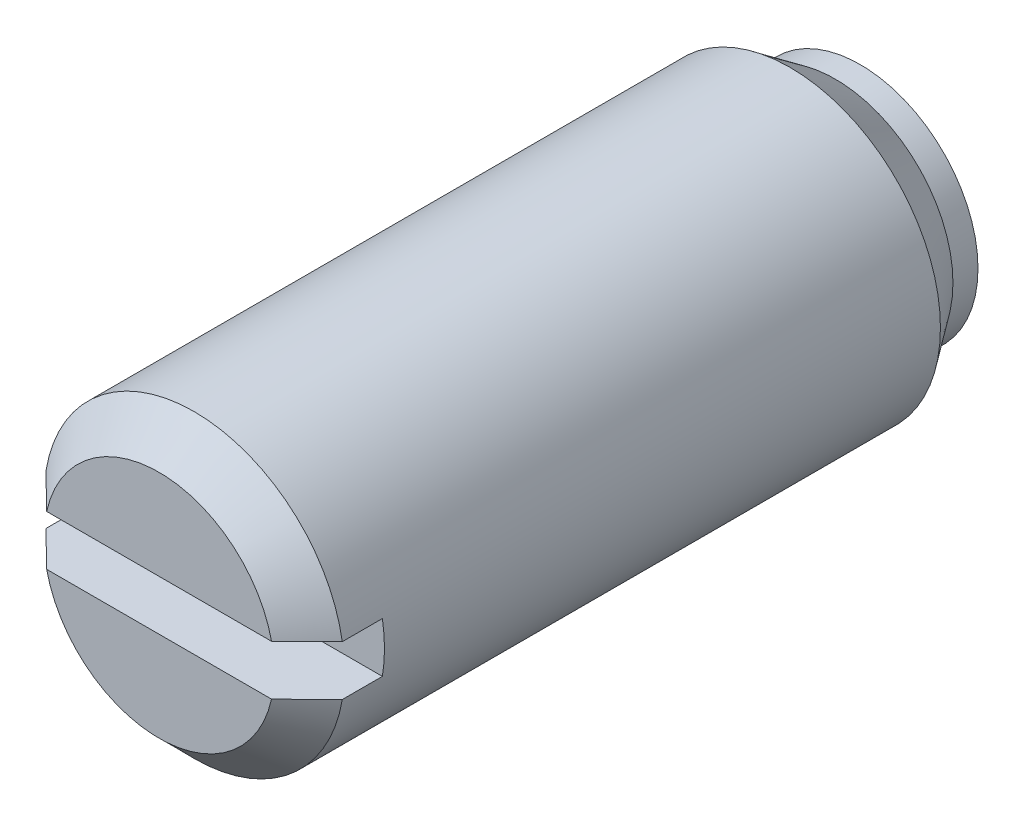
ISO-10303-21;
HEADER;
FILE_DESCRIPTION(('STEP AP214'),'2;1');
FILE_NAME('part.step','',(''),(''),'','','');
FILE_SCHEMA(('AUTOMOTIVE_DESIGN { 1 0 10303 214 1 1 1 1 }'));
ENDSEC;
DATA;
#1=APPLICATION_CONTEXT('core data for automotive mechanical design processes');
#2=APPLICATION_PROTOCOL_DEFINITION('international standard','automotive_design',2000,#1);
#3=PRODUCT_CONTEXT('',#1,'mechanical');
#4=PRODUCT('Part','Part','',(#3));
#5=PRODUCT_RELATED_PRODUCT_CATEGORY('part','',(#4));
#6=PRODUCT_DEFINITION_FORMATION('','',#4);
#7=PRODUCT_DEFINITION_CONTEXT('part definition',#1,'design');
#8=PRODUCT_DEFINITION('design','',#6,#7);
#9=PRODUCT_DEFINITION_SHAPE('','',#8);
#10=(LENGTH_UNIT() NAMED_UNIT(*) SI_UNIT(.MILLI.,.METRE.));
#11=(NAMED_UNIT(*) PLANE_ANGLE_UNIT() SI_UNIT($,.RADIAN.));
#12=(NAMED_UNIT(*) SI_UNIT($,.STERADIAN.) SOLID_ANGLE_UNIT());
#13=UNCERTAINTY_MEASURE_WITH_UNIT(LENGTH_MEASURE(1.E-05),#10,'distance_accuracy_value','');
#14=(GEOMETRIC_REPRESENTATION_CONTEXT(3) GLOBAL_UNCERTAINTY_ASSIGNED_CONTEXT((#13)) GLOBAL_UNIT_ASSIGNED_CONTEXT((#10,
#11,#12)) REPRESENTATION_CONTEXT('',''));
#15=CARTESIAN_POINT('',(0.,0.,0.));
#16=DIRECTION('',(0.,0.,1.));
#17=DIRECTION('',(1.,0.,0.));
#18=AXIS2_PLACEMENT_3D('',#15,#16,#17);
#19=CARTESIAN_POINT('',(0.,0.,-5.));
#20=DIRECTION('',(0.,0.,-1.));
#21=DIRECTION('',(-1.,0.,0.));
#22=AXIS2_PLACEMENT_3D('',#19,#20,#21);
#23=CYLINDRICAL_SURFACE('',#22,3.);
#24=CARTESIAN_POINT('',(0.,0.,2.4));
#25=DIRECTION('',(0.,0.,1.));
#26=DIRECTION('',(1.,0.,0.));
#27=AXIS2_PLACEMENT_3D('',#24,#25,#26);
#28=CIRCLE('',#27,3.);
#29=CARTESIAN_POINT('',(3.,0.,2.4));
#30=VERTEX_POINT('',#29);
#31=EDGE_CURVE('E78',#30,#30,#28,.T.);
#32=ORIENTED_EDGE('',*,*,#31,.T.);
#33=EDGE_LOOP('',(#32));
#34=FACE_BOUND('',#33,.T.);
#35=DIRECTION('',(0.,0.,1.));
#36=VECTOR('',#35,1.);
#37=CARTESIAN_POINT('',(-2.95803989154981,0.5,13.5));
#38=LINE('',#37,#36);
#39=CARTESIAN_POINT('',(-2.95803989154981,0.5,13.5));
#40=VERTEX_POINT('',#39);
#41=CARTESIAN_POINT('',(-2.95803989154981,0.5,14.3));
#42=VERTEX_POINT('',#41);
#43=EDGE_CURVE('E87',#40,#42,#38,.T.);
#44=ORIENTED_EDGE('',*,*,#43,.T.);
#45=CARTESIAN_POINT('',(0.,0.,14.3));
#46=DIRECTION('',(0.,0.,1.));
#47=DIRECTION('',(1.,0.,0.));
#48=AXIS2_PLACEMENT_3D('',#45,#46,#47);
#49=CIRCLE('',#48,3.);
#50=CARTESIAN_POINT('',(2.95803989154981,0.5,14.3));
#51=VERTEX_POINT('',#50);
#52=EDGE_CURVE('E35',#51,#42,#49,.T.);
#53=ORIENTED_EDGE('',*,*,#52,.F.);
#54=DIRECTION('',(0.,0.,1.));
#55=VECTOR('',#54,1.);
#56=CARTESIAN_POINT('',(2.95803989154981,0.5,13.5));
#57=LINE('',#56,#55);
#58=CARTESIAN_POINT('',(2.95803989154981,0.5,13.5));
#59=VERTEX_POINT('',#58);
#60=EDGE_CURVE('E85',#59,#51,#57,.T.);
#61=ORIENTED_EDGE('',*,*,#60,.F.);
#62=CARTESIAN_POINT('',(0.,0.,13.5));
#63=DIRECTION('',(0.,0.,1.));
#64=DIRECTION('',(1.,0.,0.));
#65=AXIS2_PLACEMENT_3D('',#62,#63,#64);
#66=CIRCLE('',#65,3.);
#67=CARTESIAN_POINT('',(2.95803989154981,-0.5,13.5));
#68=VERTEX_POINT('',#67);
#69=EDGE_CURVE('E117',#68,#59,#66,.T.);
#70=ORIENTED_EDGE('',*,*,#69,.F.);
#71=DIRECTION('',(0.,0.,1.));
#72=VECTOR('',#71,1.);
#73=CARTESIAN_POINT('',(2.95803989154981,-0.5,13.5));
#74=LINE('',#73,#72);
#75=CARTESIAN_POINT('',(2.95803989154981,-0.5,14.3));
#76=VERTEX_POINT('',#75);
#77=EDGE_CURVE('E94',#68,#76,#74,.T.);
#78=ORIENTED_EDGE('',*,*,#77,.T.);
#79=CARTESIAN_POINT('',(-2.95803989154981,-0.5,14.3));
#80=VERTEX_POINT('',#79);
#81=EDGE_CURVE('E88',#80,#76,#49,.T.);
#82=ORIENTED_EDGE('',*,*,#81,.F.);
#83=DIRECTION('',(0.,0.,1.));
#84=VECTOR('',#83,1.);
#85=CARTESIAN_POINT('',(-2.95803989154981,-0.5,13.5));
#86=LINE('',#85,#84);
#87=CARTESIAN_POINT('',(-2.95803989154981,-0.5,13.5));
#88=VERTEX_POINT('',#87);
#89=EDGE_CURVE('E99',#88,#80,#86,.T.);
#90=ORIENTED_EDGE('',*,*,#89,.F.);
#91=EDGE_CURVE('E121',#40,#88,#66,.T.);
#92=ORIENTED_EDGE('',*,*,#91,.F.);
#93=EDGE_LOOP('',(#44,#53,#61,#70,#78,#82,#90,#92));
#94=FACE_BOUND('',#93,.T.);
#95=ADVANCED_FACE('F14',(#34,#94),#23,.T.);
#96=CARTESIAN_POINT('',(0.,3.,15.));
#97=DIRECTION('',(0.,0.,1.));
#98=DIRECTION('',(1.,0.,0.));
#99=AXIS2_PLACEMENT_3D('',#96,#97,#98);
#100=PLANE('',#99);
#101=DIRECTION('',(1.,0.,0.));
#102=VECTOR('',#101,1.);
#103=CARTESIAN_POINT('',(-2.95803989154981,0.5,15.));
#104=LINE('',#103,#102);
#105=CARTESIAN_POINT('',(-2.24499443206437,0.5,15.));
#106=VERTEX_POINT('',#105);
#107=CARTESIAN_POINT('',(2.24499443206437,0.5,15.));
#108=VERTEX_POINT('',#107);
#109=EDGE_CURVE('E123',#106,#108,#104,.T.);
#110=ORIENTED_EDGE('',*,*,#109,.T.);
#111=CARTESIAN_POINT('',(0.,0.,15.));
#112=DIRECTION('',(0.,0.,1.));
#113=DIRECTION('',(1.,0.,0.));
#114=AXIS2_PLACEMENT_3D('',#111,#112,#113);
#115=CIRCLE('',#114,2.3);
#116=EDGE_CURVE('E73',#108,#106,#115,.T.);
#117=ORIENTED_EDGE('',*,*,#116,.T.);
#118=EDGE_LOOP('',(#110,#117));
#119=FACE_BOUND('',#118,.T.);
#120=ADVANCED_FACE('F165',(#119),#100,.T.);
#121=DIRECTION('',(1.,0.,0.));
#122=VECTOR('',#121,1.);
#123=CARTESIAN_POINT('',(-2.95803989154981,-0.5,15.));
#124=LINE('',#123,#122);
#125=CARTESIAN_POINT('',(-2.24499443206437,-0.5,15.));
#126=VERTEX_POINT('',#125);
#127=CARTESIAN_POINT('',(2.24499443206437,-0.5,15.));
#128=VERTEX_POINT('',#127);
#129=EDGE_CURVE('E125',#126,#128,#124,.T.);
#130=ORIENTED_EDGE('',*,*,#129,.F.);
#131=EDGE_CURVE('E42',#126,#128,#115,.T.);
#132=ORIENTED_EDGE('',*,*,#131,.T.);
#133=EDGE_LOOP('',(#130,#132));
#134=FACE_BOUND('',#133,.T.);
#135=ADVANCED_FACE('F163',(#134),#100,.T.);
#136=CARTESIAN_POINT('',(-2.95803989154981,0.5,13.5));
#137=DIRECTION('',(0.,-1.,0.));
#138=DIRECTION('',(1.,0.,0.));
#139=AXIS2_PLACEMENT_3D('',#136,#137,#138);
#140=PLANE('',#139);
#141=ORIENTED_EDGE('',*,*,#60,.T.);
#142=CARTESIAN_POINT('',(6.53264893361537,0.5,10.7482443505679));
#143=CARTESIAN_POINT('',(6.30108594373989,0.5,10.9791261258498));
#144=CARTESIAN_POINT('',(6.06949276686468,0.5,11.2099776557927));
#145=CARTESIAN_POINT('',(5.60619628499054,0.5,11.6715875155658));
#146=CARTESIAN_POINT('',(5.37449297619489,0.5,11.9023458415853));
#147=CARTESIAN_POINT('',(4.91073295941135,0.5,12.3639291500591));
#148=CARTESIAN_POINT('',(4.67867612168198,0.5,12.5947540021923));
#149=CARTESIAN_POINT('',(4.21434980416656,0.5,13.0561728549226));
#150=CARTESIAN_POINT('',(3.98208033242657,0.5,13.2867668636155));
#151=CARTESIAN_POINT('',(3.52760074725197,0.5,13.7372639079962));
#152=CARTESIAN_POINT('',(3.30540641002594,0.5,13.9571828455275));
#153=CARTESIAN_POINT('',(2.97165789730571,0.5,14.2866230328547));
#154=CARTESIAN_POINT('',(2.86032605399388,0.5,14.3963694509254));
#155=CARTESIAN_POINT('',(2.63745228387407,0.5,14.6156464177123));
#156=CARTESIAN_POINT('',(2.52591035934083,0.5,14.72517696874));
#157=CARTESIAN_POINT('',(2.30258249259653,0.5,14.9438653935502));
#158=CARTESIAN_POINT('',(2.19079671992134,0.5,15.0530234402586));
#159=CARTESIAN_POINT('',(1.96674862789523,0.5,15.2708587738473));
#160=CARTESIAN_POINT('',(1.85448628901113,0.5,15.3795360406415));
#161=CARTESIAN_POINT('',(1.62921665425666,0.5,15.5960762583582));
#162=CARTESIAN_POINT('',(1.51620950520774,0.5,15.7039393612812));
#163=CARTESIAN_POINT('',(1.34563480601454,0.5,15.864597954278));
#164=CARTESIAN_POINT('',(1.2886011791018,0.5,15.917959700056));
#165=CARTESIAN_POINT('',(1.17401956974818,0.5,16.0241274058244));
#166=CARTESIAN_POINT('',(1.11647159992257,0.5,16.0769333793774));
#167=CARTESIAN_POINT('',(1.02635005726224,0.5,16.1584187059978));
#168=CARTESIAN_POINT('',(0.994042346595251,0.5,16.1873918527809));
#169=CARTESIAN_POINT('',(0.929117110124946,0.5,16.2449960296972));
#170=CARTESIAN_POINT('',(0.896499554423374,0.5,16.2736270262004));
#171=CARTESIAN_POINT('',(0.830625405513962,0.5,16.3306373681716));
#172=CARTESIAN_POINT('',(0.797365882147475,0.5,16.3590133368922));
#173=CARTESIAN_POINT('',(0.730314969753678,0.5,16.4151146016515));
#174=CARTESIAN_POINT('',(0.696523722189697,0.5,16.4428400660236));
#175=CARTESIAN_POINT('',(0.627916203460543,0.5,16.4975994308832));
#176=CARTESIAN_POINT('',(0.593093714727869,0.5,16.524625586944));
#177=CARTESIAN_POINT('',(0.52240071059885,0.5,16.577266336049));
#178=CARTESIAN_POINT('',(0.486530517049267,0.5,16.6028813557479));
#179=CARTESIAN_POINT('',(0.413497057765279,0.5,16.6517377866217));
#180=CARTESIAN_POINT('',(0.376342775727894,0.5,16.6749924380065));
#181=CARTESIAN_POINT('',(0.299982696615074,0.5,16.7177726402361));
#182=CARTESIAN_POINT('',(0.260782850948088,0.5,16.7373083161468));
#183=CARTESIAN_POINT('',(0.189769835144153,0.5,16.7659199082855));
#184=CARTESIAN_POINT('',(0.158539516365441,0.5,16.7763885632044));
#185=CARTESIAN_POINT('',(0.0948435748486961,0.5,16.7920093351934));
#186=CARTESIAN_POINT('',(0.0623842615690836,0.5,16.797185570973));
#187=CARTESIAN_POINT('',(-0.00323633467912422,0.5,16.8010667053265));
#188=CARTESIAN_POINT('',(-0.0364012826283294,0.5,16.799714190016));
#189=CARTESIAN_POINT('',(-0.101929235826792,0.5,16.7907635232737));
#190=CARTESIAN_POINT('',(-0.134289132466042,0.5,16.7831441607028));
#191=CARTESIAN_POINT('',(-0.190075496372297,0.5,16.7655872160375));
#192=CARTESIAN_POINT('',(-0.21382319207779,0.5,16.7566067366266));
#193=CARTESIAN_POINT('',(-0.260461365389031,0.5,16.73662054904));
#194=CARTESIAN_POINT('',(-0.283351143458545,0.5,16.7256132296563));
#195=CARTESIAN_POINT('',(-0.328455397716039,0.5,16.7020782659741));
#196=CARTESIAN_POINT('',(-0.350666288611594,0.5,16.6895438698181));
#197=CARTESIAN_POINT('',(-0.394423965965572,0.5,16.6633957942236));
#198=CARTESIAN_POINT('',(-0.415971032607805,0.5,16.6497825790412));
#199=CARTESIAN_POINT('',(-0.488153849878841,0.5,16.602284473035));
#200=CARTESIAN_POINT('',(-0.537559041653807,0.5,16.5665427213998));
#201=CARTESIAN_POINT('',(-0.63458764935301,0.5,16.4927016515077));
#202=CARTESIAN_POINT('',(-0.682209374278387,0.5,16.4546001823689));
#203=CARTESIAN_POINT('',(-0.776411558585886,0.5,16.3769046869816));
#204=CARTESIAN_POINT('',(-0.822989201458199,0.5,16.3373072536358));
#205=CARTESIAN_POINT('',(-0.915351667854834,0.5,16.2572429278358));
#206=CARTESIAN_POINT('',(-0.961136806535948,0.5,16.2167763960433));
#207=CARTESIAN_POINT('',(-1.05225592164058,0.5,16.1351688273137));
#208=CARTESIAN_POINT('',(-1.09758888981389,0.5,16.0940266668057));
#209=CARTESIAN_POINT('',(-1.1878701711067,0.5,16.0113144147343));
#210=CARTESIAN_POINT('',(-1.23281844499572,0.5,15.9697442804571));
#211=CARTESIAN_POINT('',(-1.36709776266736,0.5,15.8447059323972));
#212=CARTESIAN_POINT('',(-1.4560041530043,0.5,15.7607821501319));
#213=CARTESIAN_POINT('',(-1.63233921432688,0.5,15.5930101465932));
#214=CARTESIAN_POINT('',(-1.71977396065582,0.5,15.5091682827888));
#215=CARTESIAN_POINT('',(-1.89421663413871,0.5,15.341041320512));
#216=CARTESIAN_POINT('',(-1.98122455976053,0.5,15.2567562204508));
#217=CARTESIAN_POINT('',(-2.24182865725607,0.5,15.0034582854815));
#218=CARTESIAN_POINT('',(-2.41499945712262,0.5,14.8340082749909));
#219=CARTESIAN_POINT('',(-2.76086347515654,0.5,14.4944115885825));
#220=CARTESIAN_POINT('',(-2.93355633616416,0.5,14.324264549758));
#221=CARTESIAN_POINT('',(-3.27858864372,0.5,13.9836177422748));
#222=CARTESIAN_POINT('',(-3.45092809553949,0.5,13.8131179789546));
#223=CARTESIAN_POINT('',(-3.7949876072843,0.5,13.4722874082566));
#224=CARTESIAN_POINT('',(-3.96670817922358,0.5,13.3019571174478));
#225=CARTESIAN_POINT('',(-4.30999914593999,0.5,12.9611439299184));
#226=CARTESIAN_POINT('',(-4.48156954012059,0.5,12.7906610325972));
#227=CARTESIAN_POINT('',(-4.99607066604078,0.5,12.2791075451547));
#228=CARTESIAN_POINT('',(-5.33884463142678,0.5,11.9378793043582));
#229=CARTESIAN_POINT('',(-5.82334957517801,0.5,11.4552369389));
#230=CARTESIAN_POINT('',(-5.96517504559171,0.5,11.3139176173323));
#231=CARTESIAN_POINT('',(-6.24888780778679,0.5,11.0311514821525));
#232=CARTESIAN_POINT('',(-6.390775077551,0.5,10.8897046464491));
#233=CARTESIAN_POINT('',(-6.53264893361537,0.5,10.7482443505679));
#234=B_SPLINE_CURVE_WITH_KNOTS('',3,(#142,#143,#144,#145,#146,#147,#148,#149,#150,#151,#152,
#153,#154,#155,#156,#157,#158,#159,#160,#161,#162,#163,#164,#165,#166,#167,#168,#169,#170,#171,
#172,#173,#174,#175,#176,#177,#178,#179,#180,#181,#182,#183,#184,#185,#186,#187,#188,#189,#190,
#191,#192,#193,#194,#195,#196,#197,#198,#199,#200,#201,#202,#203,#204,#205,#206,#207,#208,#209,
#210,#211,#212,#213,#214,#215,#216,#217,#218,#219,#220,#221,#222,#223,#224,#225,#226,#227,#228,
#229,#230,#231,#232,#233),.UNSPECIFIED.,.F.,.F.,(4,2,2,2,2,2,2,2,2,2,2,2,2,2,2,2,2,2,2,2,2,2,2,
2,2,2,2,2,2,2,2,2,2,2,2,2,2,2,2,2,2,2,2,2,2,4),(0.,0.980994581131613,1.96202587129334,
2.9439495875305,3.92583756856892,4.86371311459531,5.33270277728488,5.80168739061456,
6.27041203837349,6.73915608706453,7.20781034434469,7.44212171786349,7.67642736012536,
7.80661422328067,7.93681377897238,8.06796650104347,8.19908490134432,8.33130231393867,
8.46347952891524,8.59486875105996,8.72589497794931,8.82438544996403,8.92242505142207,
9.0213283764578,9.12056783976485,9.19662857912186,9.27275004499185,9.34922120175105,
9.42565962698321,9.6084286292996,9.79136674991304,9.97475013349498,10.1580588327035,
10.3417116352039,10.5253829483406,10.8921554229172,11.2555662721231,11.618978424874,
12.345826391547,13.073119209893,13.8004011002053,14.5260064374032,15.2516146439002,
16.7026058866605,17.3032476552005,17.9042907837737),.UNSPECIFIED.);
#235=EDGE_CURVE('E70',#51,#108,#234,.T.);
#236=ORIENTED_EDGE('',*,*,#235,.T.);
#237=ORIENTED_EDGE('',*,*,#109,.F.);
#238=EDGE_CURVE('E79',#106,#42,#234,.T.);
#239=ORIENTED_EDGE('',*,*,#238,.T.);
#240=ORIENTED_EDGE('',*,*,#43,.F.);
#241=DIRECTION('',(1.,0.,0.));
#242=VECTOR('',#241,1.);
#243=CARTESIAN_POINT('',(-2.95803989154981,0.5,13.5));
#244=LINE('',#243,#242);
#245=EDGE_CURVE('E93',#40,#59,#244,.T.);
#246=ORIENTED_EDGE('',*,*,#245,.T.);
#247=EDGE_LOOP('',(#141,#236,#237,#239,#240,#246));
#248=FACE_BOUND('',#247,.T.);
#249=ADVANCED_FACE('F91',(#248),#140,.T.);
#250=CARTESIAN_POINT('',(-2.95803989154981,-0.5,13.5));
#251=DIRECTION('',(0.,-1.,0.));
#252=DIRECTION('',(1.,0.,0.));
#253=AXIS2_PLACEMENT_3D('',#250,#251,#252);
#254=PLANE('',#253);
#255=CARTESIAN_POINT('',(6.53264893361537,-0.5,10.7482443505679));
#256=CARTESIAN_POINT('',(6.30108594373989,-0.5,10.9791261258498));
#257=CARTESIAN_POINT('',(6.06949276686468,-0.5,11.2099776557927));
#258=CARTESIAN_POINT('',(5.60619628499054,-0.5,11.6715875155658));
#259=CARTESIAN_POINT('',(5.3744929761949,-0.5,11.9023458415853));
#260=CARTESIAN_POINT('',(4.91073295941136,-0.5,12.3639291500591));
#261=CARTESIAN_POINT('',(4.67867612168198,-0.5,12.5947540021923));
#262=CARTESIAN_POINT('',(4.21434980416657,-0.5,13.0561728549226));
#263=CARTESIAN_POINT('',(3.98208033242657,-0.5,13.2867668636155));
#264=CARTESIAN_POINT('',(3.52760074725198,-0.5,13.7372639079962));
#265=CARTESIAN_POINT('',(3.30540641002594,-0.5,13.9571828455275));
#266=CARTESIAN_POINT('',(2.97165789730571,-0.5,14.2866230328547));
#267=CARTESIAN_POINT('',(2.86032605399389,-0.5,14.3963694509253));
#268=CARTESIAN_POINT('',(2.63745228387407,-0.5,14.6156464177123));
#269=CARTESIAN_POINT('',(2.52591035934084,-0.5,14.72517696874));
#270=CARTESIAN_POINT('',(2.30258249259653,-0.5,14.9438653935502));
#271=CARTESIAN_POINT('',(2.19079671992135,-0.5,15.0530234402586));
#272=CARTESIAN_POINT('',(1.96674862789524,-0.5,15.2708587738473));
#273=CARTESIAN_POINT('',(1.85448628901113,-0.5,15.3795360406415));
#274=CARTESIAN_POINT('',(1.62921665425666,-0.5,15.5960762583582));
#275=CARTESIAN_POINT('',(1.51620950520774,-0.5,15.7039393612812));
#276=CARTESIAN_POINT('',(1.34563480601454,-0.5,15.864597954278));
#277=CARTESIAN_POINT('',(1.2886011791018,-0.5,15.917959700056));
#278=CARTESIAN_POINT('',(1.17401956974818,-0.5,16.0241274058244));
#279=CARTESIAN_POINT('',(1.11647159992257,-0.5,16.0769333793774));
#280=CARTESIAN_POINT('',(1.02635005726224,-0.5,16.1584187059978));
#281=CARTESIAN_POINT('',(0.994042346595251,-0.5,16.1873918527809));
#282=CARTESIAN_POINT('',(0.929117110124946,-0.5,16.2449960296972));
#283=CARTESIAN_POINT('',(0.896499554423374,-0.5,16.2736270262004));
#284=CARTESIAN_POINT('',(0.830625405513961,-0.5,16.3306373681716));
#285=CARTESIAN_POINT('',(0.797365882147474,-0.5,16.3590133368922));
#286=CARTESIAN_POINT('',(0.730314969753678,-0.5,16.4151146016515));
#287=CARTESIAN_POINT('',(0.696523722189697,-0.5,16.4428400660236));
#288=CARTESIAN_POINT('',(0.627916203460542,-0.5,16.4975994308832));
#289=CARTESIAN_POINT('',(0.593093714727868,-0.5,16.524625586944));
#290=CARTESIAN_POINT('',(0.52240071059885,-0.5,16.577266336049));
#291=CARTESIAN_POINT('',(0.486530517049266,-0.5,16.6028813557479));
#292=CARTESIAN_POINT('',(0.413497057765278,-0.5,16.6517377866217));
#293=CARTESIAN_POINT('',(0.376342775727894,-0.5,16.6749924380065));
#294=CARTESIAN_POINT('',(0.299982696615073,-0.5,16.7177726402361));
#295=CARTESIAN_POINT('',(0.260782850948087,-0.5,16.7373083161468));
#296=CARTESIAN_POINT('',(0.189769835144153,-0.5,16.7659199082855));
#297=CARTESIAN_POINT('',(0.15853951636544,-0.5,16.7763885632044));
#298=CARTESIAN_POINT('',(0.0948435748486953,-0.5,16.7920093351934));
#299=CARTESIAN_POINT('',(0.0623842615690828,-0.5,16.797185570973));
#300=CARTESIAN_POINT('',(-0.0032363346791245,-0.5,16.8010667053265));
#301=CARTESIAN_POINT('',(-0.0364012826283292,-0.5,16.799714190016));
#302=CARTESIAN_POINT('',(-0.101929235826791,-0.5,16.7907635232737));
#303=CARTESIAN_POINT('',(-0.134289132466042,-0.5,16.7831441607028));
#304=CARTESIAN_POINT('',(-0.190075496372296,-0.5,16.7655872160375));
#305=CARTESIAN_POINT('',(-0.213823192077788,-0.5,16.7566067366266));
#306=CARTESIAN_POINT('',(-0.260461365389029,-0.5,16.73662054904));
#307=CARTESIAN_POINT('',(-0.283351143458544,-0.5,16.7256132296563));
#308=CARTESIAN_POINT('',(-0.328455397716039,-0.5,16.7020782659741));
#309=CARTESIAN_POINT('',(-0.350666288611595,-0.5,16.6895438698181));
#310=CARTESIAN_POINT('',(-0.394423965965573,-0.5,16.6633957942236));
#311=CARTESIAN_POINT('',(-0.415971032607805,-0.5,16.6497825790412));
#312=CARTESIAN_POINT('',(-0.488153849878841,-0.5,16.602284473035));
#313=CARTESIAN_POINT('',(-0.537559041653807,-0.5,16.5665427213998));
#314=CARTESIAN_POINT('',(-0.63458764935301,-0.5,16.4927016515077));
#315=CARTESIAN_POINT('',(-0.682209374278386,-0.5,16.4546001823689));
#316=CARTESIAN_POINT('',(-0.776411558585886,-0.5,16.3769046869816));
#317=CARTESIAN_POINT('',(-0.822989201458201,-0.5,16.3373072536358));
#318=CARTESIAN_POINT('',(-0.915351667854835,-0.5,16.2572429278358));
#319=CARTESIAN_POINT('',(-0.961136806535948,-0.5,16.2167763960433));
#320=CARTESIAN_POINT('',(-1.05225592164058,-0.5,16.1351688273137));
#321=CARTESIAN_POINT('',(-1.09758888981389,-0.5,16.0940266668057));
#322=CARTESIAN_POINT('',(-1.1878701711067,-0.5,16.0113144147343));
#323=CARTESIAN_POINT('',(-1.23281844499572,-0.5,15.9697442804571));
#324=CARTESIAN_POINT('',(-1.36709776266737,-0.5,15.8447059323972));
#325=CARTESIAN_POINT('',(-1.4560041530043,-0.5,15.7607821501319));
#326=CARTESIAN_POINT('',(-1.63233921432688,-0.5,15.5930101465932));
#327=CARTESIAN_POINT('',(-1.71977396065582,-0.5,15.5091682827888));
#328=CARTESIAN_POINT('',(-1.89421663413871,-0.5,15.341041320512));
#329=CARTESIAN_POINT('',(-1.98122455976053,-0.5,15.2567562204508));
#330=CARTESIAN_POINT('',(-2.24182865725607,-0.5,15.0034582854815));
#331=CARTESIAN_POINT('',(-2.41499945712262,-0.5,14.8340082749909));
#332=CARTESIAN_POINT('',(-2.76086347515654,-0.5,14.4944115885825));
#333=CARTESIAN_POINT('',(-2.93355633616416,-0.5,14.324264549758));
#334=CARTESIAN_POINT('',(-3.27858864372,-0.5,13.9836177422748));
#335=CARTESIAN_POINT('',(-3.45092809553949,-0.5,13.8131179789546));
#336=CARTESIAN_POINT('',(-3.7949876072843,-0.5,13.4722874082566));
#337=CARTESIAN_POINT('',(-3.96670817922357,-0.5,13.3019571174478));
#338=CARTESIAN_POINT('',(-4.30999914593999,-0.5,12.9611439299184));
#339=CARTESIAN_POINT('',(-4.48156954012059,-0.5,12.7906610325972));
#340=CARTESIAN_POINT('',(-4.99607066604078,-0.5,12.2791075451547));
#341=CARTESIAN_POINT('',(-5.33884463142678,-0.5,11.9378793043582));
#342=CARTESIAN_POINT('',(-5.82334957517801,-0.5,11.4552369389));
#343=CARTESIAN_POINT('',(-5.96517504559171,-0.5,11.3139176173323));
#344=CARTESIAN_POINT('',(-6.24888780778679,-0.5,11.0311514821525));
#345=CARTESIAN_POINT('',(-6.390775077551,-0.5,10.8897046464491));
#346=CARTESIAN_POINT('',(-6.53264893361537,-0.5,10.7482443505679));
#347=B_SPLINE_CURVE_WITH_KNOTS('',3,(#255,#256,#257,#258,#259,#260,#261,#262,#263,#264,#265,
#266,#267,#268,#269,#270,#271,#272,#273,#274,#275,#276,#277,#278,#279,#280,#281,#282,#283,#284,
#285,#286,#287,#288,#289,#290,#291,#292,#293,#294,#295,#296,#297,#298,#299,#300,#301,#302,#303,
#304,#305,#306,#307,#308,#309,#310,#311,#312,#313,#314,#315,#316,#317,#318,#319,#320,#321,#322,
#323,#324,#325,#326,#327,#328,#329,#330,#331,#332,#333,#334,#335,#336,#337,#338,#339,#340,#341,
#342,#343,#344,#345,#346),.UNSPECIFIED.,.F.,.F.,(4,2,2,2,2,2,2,2,2,2,2,2,2,2,2,2,2,2,2,2,2,2,2,
2,2,2,2,2,2,2,2,2,2,2,2,2,2,2,2,2,2,2,2,2,2,4),(0.,0.980994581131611,1.96202587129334,
2.94394958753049,3.92583756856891,4.8637131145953,5.33270277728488,5.80168739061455,
6.27041203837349,6.73915608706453,7.20781034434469,7.4421217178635,7.67642736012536,
7.80661422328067,7.93681377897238,8.06796650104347,8.19908490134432,8.33130231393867,
8.46347952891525,8.59486875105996,8.72589497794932,8.82438544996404,8.92242505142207,
9.0213283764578,9.12056783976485,9.19662857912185,9.27275004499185,9.34922120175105,
9.42565962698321,9.6084286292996,9.79136674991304,9.97475013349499,10.1580588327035,
10.3417116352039,10.5253829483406,10.8921554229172,11.2555662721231,11.6189784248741,
12.345826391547,13.073119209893,13.8004011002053,14.5260064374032,15.2516146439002,
16.7026058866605,17.3032476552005,17.9042907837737),.UNSPECIFIED.);
#348=EDGE_CURVE('E9',#76,#128,#347,.T.);
#349=ORIENTED_EDGE('',*,*,#348,.F.);
#350=ORIENTED_EDGE('',*,*,#77,.F.);
#351=DIRECTION('',(1.,0.,0.));
#352=VECTOR('',#351,1.);
#353=CARTESIAN_POINT('',(-2.95803989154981,-0.5,13.5));
#354=LINE('',#353,#352);
#355=EDGE_CURVE('E116',#88,#68,#354,.T.);
#356=ORIENTED_EDGE('',*,*,#355,.F.);
#357=ORIENTED_EDGE('',*,*,#89,.T.);
#358=EDGE_CURVE('E18',#126,#80,#347,.T.);
#359=ORIENTED_EDGE('',*,*,#358,.F.);
#360=ORIENTED_EDGE('',*,*,#129,.T.);
#361=EDGE_LOOP('',(#349,#350,#356,#357,#359,#360));
#362=FACE_BOUND('',#361,.T.);
#363=ADVANCED_FACE('F115',(#362),#254,.F.);
#364=CARTESIAN_POINT('',(0.,0.,13.5));
#365=DIRECTION('',(0.,0.,1.));
#366=DIRECTION('',(1.,0.,0.));
#367=AXIS2_PLACEMENT_3D('',#364,#365,#366);
#368=PLANE('',#367);
#369=ORIENTED_EDGE('',*,*,#91,.T.);
#370=ORIENTED_EDGE('',*,*,#355,.T.);
#371=ORIENTED_EDGE('',*,*,#69,.T.);
#372=ORIENTED_EDGE('',*,*,#245,.F.);
#373=EDGE_LOOP('',(#369,#370,#371,#372));
#374=FACE_BOUND('',#373,.T.);
#375=ADVANCED_FACE('F153',(#374),#368,.T.);
#376=CARTESIAN_POINT('',(0.,0.,17.0872625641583));
#377=DIRECTION('',(0.,0.,1.));
#378=DIRECTION('',(1.,0.,0.));
#379=AXIS2_PLACEMENT_3D('',#376,#377,#378);
#380=CYLINDRICAL_SURFACE('',#379,2.35);
#381=CARTESIAN_POINT('',(0.,0.,1.));
#382=DIRECTION('',(0.,0.,1.));
#383=DIRECTION('',(1.,0.,0.));
#384=AXIS2_PLACEMENT_3D('',#381,#382,#383);
#385=CIRCLE('',#384,2.35);
#386=CARTESIAN_POINT('',(2.35,0.,1.));
#387=VERTEX_POINT('',#386);
#388=EDGE_CURVE('E127',#387,#387,#385,.T.);
#389=ORIENTED_EDGE('',*,*,#388,.T.);
#390=EDGE_LOOP('',(#389));
#391=FACE_BOUND('',#390,.T.);
#392=CARTESIAN_POINT('',(0.,0.,1.5));
#393=DIRECTION('',(0.,0.,1.));
#394=DIRECTION('',(1.,0.,0.));
#395=AXIS2_PLACEMENT_3D('',#392,#393,#394);
#396=CIRCLE('',#395,2.35);
#397=CARTESIAN_POINT('',(2.35,0.,1.5));
#398=VERTEX_POINT('',#397);
#399=EDGE_CURVE('E130',#398,#398,#396,.T.);
#400=ORIENTED_EDGE('',*,*,#399,.F.);
#401=EDGE_LOOP('',(#400));
#402=FACE_BOUND('',#401,.T.);
#403=ADVANCED_FACE('F149',(#391,#402),#380,.T.);
#404=CARTESIAN_POINT('',(0.,0.,2.4));
#405=DIRECTION('',(0.,0.,1.));
#406=DIRECTION('',(1.,0.,0.));
#407=AXIS2_PLACEMENT_3D('',#404,#405,#406);
#408=CONICAL_SURFACE('',#407,3.,0.625485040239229);
#409=ORIENTED_EDGE('',*,*,#399,.T.);
#410=EDGE_LOOP('',(#409));
#411=FACE_BOUND('',#410,.T.);
#412=ORIENTED_EDGE('',*,*,#31,.F.);
#413=EDGE_LOOP('',(#412));
#414=FACE_BOUND('',#413,.T.);
#415=ADVANCED_FACE('F145',(#411,#414),#408,.T.);
#416=CARTESIAN_POINT('',(0.,0.,1.75));
#417=DIRECTION('',(-1.,0.,0.));
#418=DIRECTION('',(0.,0.,1.));
#419=AXIS2_PLACEMENT_3D('',#416,#417,#418);
#420=SPHERICAL_SURFACE('',#419,1.75);
#421=CARTESIAN_POINT('',(0.,0.,1.75));
#422=DIRECTION('',(0.,0.,-1.));
#423=DIRECTION('',(-1.,0.,0.));
#424=AXIS2_PLACEMENT_3D('',#421,#422,#423);
#425=SPHERICAL_SURFACE('',#424,1.75);
#426=CARTESIAN_POINT('',(0.,0.,1.));
#427=DIRECTION('',(0.,0.,-1.));
#428=DIRECTION('',(-1.,0.,0.));
#429=AXIS2_PLACEMENT_3D('',#426,#427,#428);
#430=CIRCLE('',#429,1.58113883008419);
#431=CARTESIAN_POINT('',(-1.58113883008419,0.,1.));
#432=VERTEX_POINT('',#431);
#433=EDGE_CURVE('E96',#432,#432,#430,.T.);
#434=ORIENTED_EDGE('',*,*,#433,.T.);
#435=EDGE_LOOP('',(#434));
#436=FACE_BOUND('',#435,.T.);
#437=ADVANCED_FACE('F16',(#436),#425,.T.);
#438=CARTESIAN_POINT('',(0.,1.58113883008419,1.));
#439=DIRECTION('',(0.,0.,-1.));
#440=DIRECTION('',(-1.,0.,0.));
#441=AXIS2_PLACEMENT_3D('',#438,#439,#440);
#442=PLANE('',#441);
#443=ORIENTED_EDGE('',*,*,#433,.F.);
#444=EDGE_LOOP('',(#443));
#445=FACE_BOUND('',#444,.T.);
#446=ORIENTED_EDGE('',*,*,#388,.F.);
#447=EDGE_LOOP('',(#446));
#448=FACE_BOUND('',#447,.T.);
#449=ADVANCED_FACE('F172',(#445,#448),#442,.T.);
#450=CARTESIAN_POINT('',(0.,0.,15.));
#451=DIRECTION('',(0.,0.,-1.));
#452=DIRECTION('',(-1.,0.,0.));
#453=AXIS2_PLACEMENT_3D('',#450,#451,#452);
#454=CONICAL_SURFACE('',#453,2.3,0.785398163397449);
#455=ORIENTED_EDGE('',*,*,#348,.T.);
#456=ORIENTED_EDGE('',*,*,#131,.F.);
#457=ORIENTED_EDGE('',*,*,#358,.T.);
#458=ORIENTED_EDGE('',*,*,#81,.T.);
#459=EDGE_LOOP('',(#455,#456,#457,#458));
#460=FACE_BOUND('',#459,.T.);
#461=ADVANCED_FACE('F106',(#460),#454,.T.);
#462=ORIENTED_EDGE('',*,*,#52,.T.);
#463=ORIENTED_EDGE('',*,*,#238,.F.);
#464=ORIENTED_EDGE('',*,*,#116,.F.);
#465=ORIENTED_EDGE('',*,*,#235,.F.);
#466=EDGE_LOOP('',(#462,#463,#464,#465));
#467=FACE_BOUND('',#466,.T.);
#468=ADVANCED_FACE('F71',(#467),#454,.T.);
#469=CLOSED_SHELL('',(#95,#120,#135,#249,#363,#375,#403,#415,#437,#449,#461,#468));
#470=MANIFOLD_SOLID_BREP('B1',#469);
#471=ADVANCED_BREP_SHAPE_REPRESENTATION('',(#18,#470),#14);
#472=SHAPE_DEFINITION_REPRESENTATION(#9,#471);
ENDSEC;
END-ISO-10303-21;
